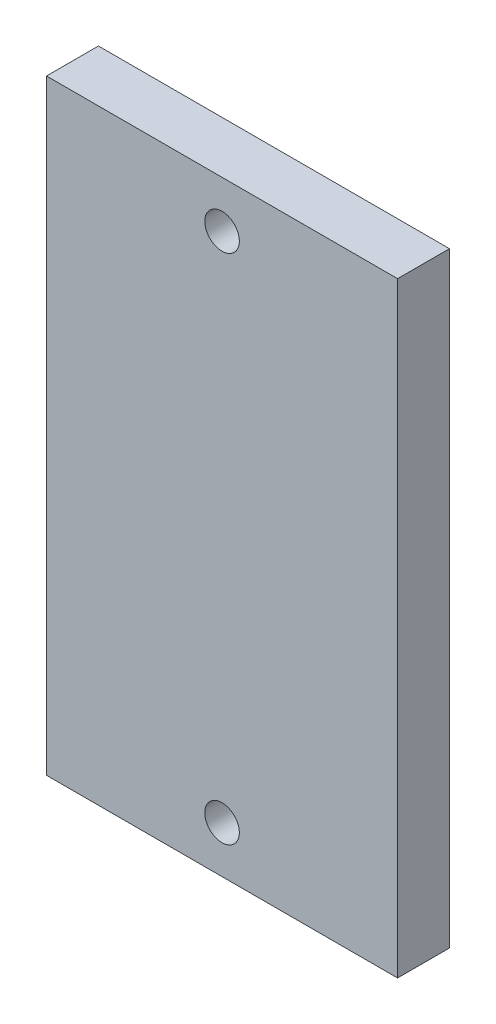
from build123d import *

# Parameters (mm, degrees)
SKETCH1_W           = 20.286851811
SKETCH1_H           = 35
SKETCH1_R           = 1
BOSS_EXTRUDE1_DEPTH = 3


with BuildPart() as part:
    # Sketch1 → Boss-Extrude1 (new body)
    with BuildSketch(Plane.XY):
        with Locations((209.048939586, 242.451467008)):
            Rectangle(SKETCH1_W, SKETCH1_H)
        with Locations((209.048939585, 227.651467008)):
            Circle(SKETCH1_R, mode=Mode.SUBTRACT)
        with Locations((209.048939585, 257.251467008)):
            Circle(SKETCH1_R, mode=Mode.SUBTRACT)
    extrude(amount=BOSS_EXTRUDE1_DEPTH)


solid = part.part
